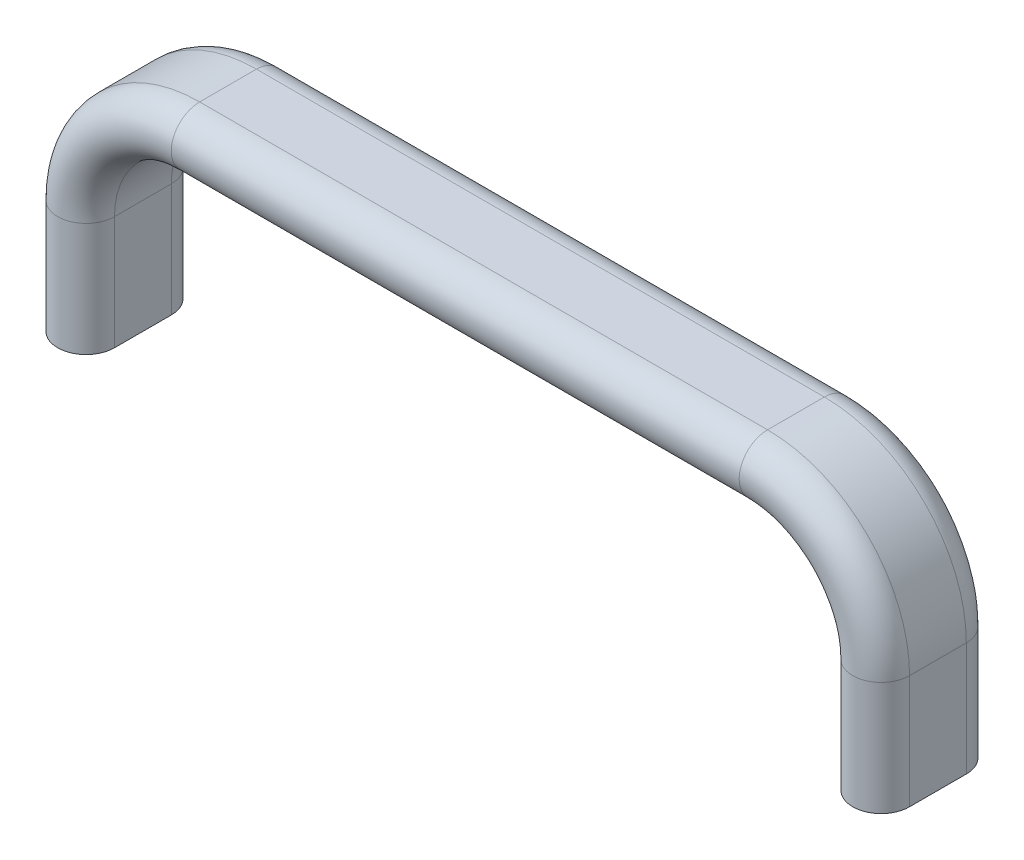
ISO-10303-21;
HEADER;
FILE_DESCRIPTION(('STEP AP214'),'2;1');
FILE_NAME('part.step','',(''),(''),'','','');
FILE_SCHEMA(('AUTOMOTIVE_DESIGN { 1 0 10303 214 1 1 1 1 }'));
ENDSEC;
DATA;
#1=APPLICATION_CONTEXT('core data for automotive mechanical design processes');
#2=APPLICATION_PROTOCOL_DEFINITION('international standard','automotive_design',2000,#1);
#3=PRODUCT_CONTEXT('',#1,'mechanical');
#4=PRODUCT('Part','Part','',(#3));
#5=PRODUCT_RELATED_PRODUCT_CATEGORY('part','',(#4));
#6=PRODUCT_DEFINITION_FORMATION('','',#4);
#7=PRODUCT_DEFINITION_CONTEXT('part definition',#1,'design');
#8=PRODUCT_DEFINITION('design','',#6,#7);
#9=PRODUCT_DEFINITION_SHAPE('','',#8);
#10=(LENGTH_UNIT() NAMED_UNIT(*) SI_UNIT(.MILLI.,.METRE.));
#11=(NAMED_UNIT(*) PLANE_ANGLE_UNIT() SI_UNIT($,.RADIAN.));
#12=(NAMED_UNIT(*) SI_UNIT($,.STERADIAN.) SOLID_ANGLE_UNIT());
#13=UNCERTAINTY_MEASURE_WITH_UNIT(LENGTH_MEASURE(1.E-05),#10,'distance_accuracy_value','');
#14=(GEOMETRIC_REPRESENTATION_CONTEXT(3) GLOBAL_UNCERTAINTY_ASSIGNED_CONTEXT((#13)) GLOBAL_UNIT_ASSIGNED_CONTEXT((#10,
#11,#12)) REPRESENTATION_CONTEXT('',''));
#15=CARTESIAN_POINT('',(0.,0.,0.));
#16=DIRECTION('',(0.,0.,1.));
#17=DIRECTION('',(1.,0.,0.));
#18=AXIS2_PLACEMENT_3D('',#15,#16,#17);
#19=CARTESIAN_POINT('',(70.,0.,-5.));
#20=DIRECTION('',(0.,1.,0.));
#21=DIRECTION('',(0.,0.,-1.));
#22=AXIS2_PLACEMENT_3D('',#19,#20,#21);
#23=PLANE('',#22);
#24=CARTESIAN_POINT('',(70.,0.,-5.));
#25=DIRECTION('',(0.,-1.,0.));
#26=DIRECTION('',(0.,0.,-1.));
#27=AXIS2_PLACEMENT_3D('',#24,#25,#26);
#28=CIRCLE('',#27,5.);
#29=CARTESIAN_POINT('',(65.,0.,-5.));
#30=VERTEX_POINT('',#29);
#31=CARTESIAN_POINT('',(75.,0.,-5.));
#32=VERTEX_POINT('',#31);
#33=EDGE_CURVE('E279',#30,#32,#28,.T.);
#34=ORIENTED_EDGE('',*,*,#33,.T.);
#35=DIRECTION('',(0.,0.,1.));
#36=VECTOR('',#35,1.);
#37=CARTESIAN_POINT('',(75.,0.,5.00000000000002));
#38=LINE('',#37,#36);
#39=CARTESIAN_POINT('',(75.,0.,5.00000000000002));
#40=VERTEX_POINT('',#39);
#41=EDGE_CURVE('E55',#32,#40,#38,.T.);
#42=ORIENTED_EDGE('',*,*,#41,.T.);
#43=CARTESIAN_POINT('',(70.,0.,5.00000000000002));
#44=DIRECTION('',(0.,-1.,0.));
#45=DIRECTION('',(0.,0.,1.));
#46=AXIS2_PLACEMENT_3D('',#43,#44,#45);
#47=CIRCLE('',#46,5.);
#48=CARTESIAN_POINT('',(65.,0.,5.00000000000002));
#49=VERTEX_POINT('',#48);
#50=EDGE_CURVE('E63',#40,#49,#47,.T.);
#51=ORIENTED_EDGE('',*,*,#50,.T.);
#52=DIRECTION('',(0.,0.,-1.));
#53=VECTOR('',#52,1.);
#54=CARTESIAN_POINT('',(65.,0.,-5.));
#55=LINE('',#54,#53);
#56=EDGE_CURVE('E282',#49,#30,#55,.T.);
#57=ORIENTED_EDGE('',*,*,#56,.T.);
#58=EDGE_LOOP('',(#34,#42,#51,#57));
#59=FACE_BOUND('',#58,.T.);
#60=CARTESIAN_POINT('',(70.,0.,0.));
#61=DIRECTION('',(0.,1.,0.));
#62=DIRECTION('',(0.,0.,-1.));
#63=AXIS2_PLACEMENT_3D('',#60,#61,#62);
#64=CIRCLE('',#63,2.5);
#65=CARTESIAN_POINT('',(70.,0.,-2.5));
#66=VERTEX_POINT('',#65);
#67=EDGE_CURVE('E443',#66,#66,#64,.T.);
#68=ORIENTED_EDGE('',*,*,#67,.T.);
#69=EDGE_LOOP('',(#68));
#70=FACE_BOUND('',#69,.T.);
#71=ADVANCED_FACE('F37',(#59,#70),#23,.F.);
#72=CARTESIAN_POINT('',(75.,20.,5.00000000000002));
#73=DIRECTION('',(1.,0.,0.));
#74=DIRECTION('',(0.,0.,-1.));
#75=AXIS2_PLACEMENT_3D('',#72,#73,#74);
#76=PLANE('',#75);
#77=DIRECTION('',(0.,0.,1.));
#78=VECTOR('',#77,1.);
#79=CARTESIAN_POINT('',(75.,20.,5.00000000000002));
#80=LINE('',#79,#78);
#81=CARTESIAN_POINT('',(75.,20.,-5.));
#82=VERTEX_POINT('',#81);
#83=CARTESIAN_POINT('',(75.,20.,5.00000000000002));
#84=VERTEX_POINT('',#83);
#85=EDGE_CURVE('E247',#82,#84,#80,.T.);
#86=ORIENTED_EDGE('',*,*,#85,.T.);
#87=DIRECTION('',(0.,-1.,0.));
#88=VECTOR('',#87,1.);
#89=CARTESIAN_POINT('',(75.,20.,5.00000000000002));
#90=LINE('',#89,#88);
#91=EDGE_CURVE('E47',#84,#40,#90,.T.);
#92=ORIENTED_EDGE('',*,*,#91,.T.);
#93=ORIENTED_EDGE('',*,*,#41,.F.);
#94=DIRECTION('',(0.,-1.,0.));
#95=VECTOR('',#94,1.);
#96=CARTESIAN_POINT('',(75.,20.,-5.));
#97=LINE('',#96,#95);
#98=EDGE_CURVE('E11',#82,#32,#97,.T.);
#99=ORIENTED_EDGE('',*,*,#98,.F.);
#100=EDGE_LOOP('',(#86,#92,#93,#99));
#101=FACE_BOUND('',#100,.T.);
#102=ADVANCED_FACE('F39',(#101),#76,.T.);
#103=CARTESIAN_POINT('',(70.,20.,5.00000000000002));
#104=DIRECTION('',(0.,-1.,0.));
#105=DIRECTION('',(0.,0.,-1.));
#106=AXIS2_PLACEMENT_3D('',#103,#104,#105);
#107=CYLINDRICAL_SURFACE('',#106,5.);
#108=CARTESIAN_POINT('',(70.,20.,5.00000000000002));
#109=DIRECTION('',(0.,-1.,0.));
#110=DIRECTION('',(0.,0.,1.));
#111=AXIS2_PLACEMENT_3D('',#108,#109,#110);
#112=CIRCLE('',#111,5.);
#113=CARTESIAN_POINT('',(65.,20.,5.00000000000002));
#114=VERTEX_POINT('',#113);
#115=EDGE_CURVE('E240',#84,#114,#112,.T.);
#116=ORIENTED_EDGE('',*,*,#115,.T.);
#117=DIRECTION('',(0.,-1.,0.));
#118=VECTOR('',#117,1.);
#119=CARTESIAN_POINT('',(65.,20.,5.00000000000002));
#120=LINE('',#119,#118);
#121=EDGE_CURVE('E242',#114,#49,#120,.T.);
#122=ORIENTED_EDGE('',*,*,#121,.T.);
#123=ORIENTED_EDGE('',*,*,#50,.F.);
#124=ORIENTED_EDGE('',*,*,#91,.F.);
#125=EDGE_LOOP('',(#116,#122,#123,#124));
#126=FACE_BOUND('',#125,.T.);
#127=ADVANCED_FACE('F153',(#126),#107,.T.);
#128=CARTESIAN_POINT('',(65.,20.,-5.));
#129=DIRECTION('',(-1.,0.,0.));
#130=DIRECTION('',(0.,0.,1.));
#131=AXIS2_PLACEMENT_3D('',#128,#129,#130);
#132=PLANE('',#131);
#133=DIRECTION('',(0.,0.,-1.));
#134=VECTOR('',#133,1.);
#135=CARTESIAN_POINT('',(65.,20.,-5.));
#136=LINE('',#135,#134);
#137=CARTESIAN_POINT('',(65.,20.,-5.));
#138=VERTEX_POINT('',#137);
#139=EDGE_CURVE('E248',#114,#138,#136,.T.);
#140=ORIENTED_EDGE('',*,*,#139,.T.);
#141=DIRECTION('',(0.,-1.,0.));
#142=VECTOR('',#141,1.);
#143=CARTESIAN_POINT('',(65.,20.,-5.));
#144=LINE('',#143,#142);
#145=EDGE_CURVE('E290',#138,#30,#144,.T.);
#146=ORIENTED_EDGE('',*,*,#145,.T.);
#147=ORIENTED_EDGE('',*,*,#56,.F.);
#148=ORIENTED_EDGE('',*,*,#121,.F.);
#149=EDGE_LOOP('',(#140,#146,#147,#148));
#150=FACE_BOUND('',#149,.T.);
#151=ADVANCED_FACE('F231',(#150),#132,.T.);
#152=CARTESIAN_POINT('',(70.,20.,-5.));
#153=DIRECTION('',(0.,-1.,0.));
#154=DIRECTION('',(0.,0.,-1.));
#155=AXIS2_PLACEMENT_3D('',#152,#153,#154);
#156=CYLINDRICAL_SURFACE('',#155,5.);
#157=CARTESIAN_POINT('',(70.,20.,-5.));
#158=DIRECTION('',(0.,-1.,0.));
#159=DIRECTION('',(0.,0.,-1.));
#160=AXIS2_PLACEMENT_3D('',#157,#158,#159);
#161=CIRCLE('',#160,5.);
#162=EDGE_CURVE('E259',#138,#82,#161,.T.);
#163=ORIENTED_EDGE('',*,*,#162,.T.);
#164=ORIENTED_EDGE('',*,*,#98,.T.);
#165=ORIENTED_EDGE('',*,*,#33,.F.);
#166=ORIENTED_EDGE('',*,*,#145,.F.);
#167=EDGE_LOOP('',(#163,#164,#165,#166));
#168=FACE_BOUND('',#167,.T.);
#169=ADVANCED_FACE('F227',(#168),#156,.T.);
#170=CARTESIAN_POINT('',(50.,20.,0.));
#171=DIRECTION('',(0.,0.,-1.));
#172=DIRECTION('',(-1.,0.,0.));
#173=AXIS2_PLACEMENT_3D('',#170,#171,#172);
#174=CYLINDRICAL_SURFACE('',#173,25.);
#175=DIRECTION('',(0.,0.,1.));
#176=VECTOR('',#175,1.);
#177=CARTESIAN_POINT('',(50.,45.,5.00000000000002));
#178=LINE('',#177,#176);
#179=CARTESIAN_POINT('',(50.,45.,-5.));
#180=VERTEX_POINT('',#179);
#181=CARTESIAN_POINT('',(50.,45.,5.00000000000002));
#182=VERTEX_POINT('',#181);
#183=EDGE_CURVE('E399',#180,#182,#178,.T.);
#184=ORIENTED_EDGE('',*,*,#183,.T.);
#185=CARTESIAN_POINT('',(50.,20.,5.00000000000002));
#186=DIRECTION('',(0.,0.,-1.));
#187=DIRECTION('',(-1.,0.,0.));
#188=AXIS2_PLACEMENT_3D('',#185,#186,#187);
#189=CIRCLE('',#188,25.);
#190=EDGE_CURVE('E265',#182,#84,#189,.T.);
#191=ORIENTED_EDGE('',*,*,#190,.T.);
#192=ORIENTED_EDGE('',*,*,#85,.F.);
#193=CARTESIAN_POINT('',(50.,20.,-5.));
#194=DIRECTION('',(0.,0.,-1.));
#195=DIRECTION('',(-1.,0.,0.));
#196=AXIS2_PLACEMENT_3D('',#193,#194,#195);
#197=CIRCLE('',#196,25.);
#198=EDGE_CURVE('E270',#180,#82,#197,.T.);
#199=ORIENTED_EDGE('',*,*,#198,.F.);
#200=EDGE_LOOP('',(#184,#191,#192,#199));
#201=FACE_BOUND('',#200,.T.);
#202=ADVANCED_FACE('F223',(#201),#174,.T.);
#203=CARTESIAN_POINT('',(50.,20.,5.00000000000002));
#204=DIRECTION('',(0.,0.,-1.));
#205=DIRECTION('',(-1.,0.,0.));
#206=AXIS2_PLACEMENT_3D('',#203,#204,#205);
#207=TOROIDAL_SURFACE('',#206,20.,5.);
#208=CARTESIAN_POINT('',(50.,40.,5.00000000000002));
#209=DIRECTION('',(1.,0.,0.));
#210=DIRECTION('',(0.,0.,1.));
#211=AXIS2_PLACEMENT_3D('',#208,#209,#210);
#212=CIRCLE('',#211,5.);
#213=CARTESIAN_POINT('',(50.,35.,5.00000000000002));
#214=VERTEX_POINT('',#213);
#215=EDGE_CURVE('E262',#182,#214,#212,.T.);
#216=ORIENTED_EDGE('',*,*,#215,.T.);
#217=CARTESIAN_POINT('',(50.,20.,5.00000000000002));
#218=DIRECTION('',(0.,0.,-1.));
#219=DIRECTION('',(-1.,0.,0.));
#220=AXIS2_PLACEMENT_3D('',#217,#218,#219);
#221=CIRCLE('',#220,15.);
#222=EDGE_CURVE('E253',#214,#114,#221,.T.);
#223=ORIENTED_EDGE('',*,*,#222,.T.);
#224=ORIENTED_EDGE('',*,*,#115,.F.);
#225=ORIENTED_EDGE('',*,*,#190,.F.);
#226=EDGE_LOOP('',(#216,#223,#224,#225));
#227=FACE_BOUND('',#226,.T.);
#228=ADVANCED_FACE('F219',(#227),#207,.T.);
#229=CARTESIAN_POINT('',(50.,20.,0.));
#230=DIRECTION('',(0.,0.,-1.));
#231=DIRECTION('',(-1.,0.,0.));
#232=AXIS2_PLACEMENT_3D('',#229,#230,#231);
#233=CYLINDRICAL_SURFACE('',#232,15.);
#234=DIRECTION('',(0.,0.,-1.));
#235=VECTOR('',#234,1.);
#236=CARTESIAN_POINT('',(50.,35.,-5.));
#237=LINE('',#236,#235);
#238=CARTESIAN_POINT('',(50.,35.,-5.));
#239=VERTEX_POINT('',#238);
#240=EDGE_CURVE('E394',#214,#239,#237,.T.);
#241=ORIENTED_EDGE('',*,*,#240,.T.);
#242=CARTESIAN_POINT('',(50.,20.,-5.));
#243=DIRECTION('',(0.,0.,-1.));
#244=DIRECTION('',(-1.,0.,0.));
#245=AXIS2_PLACEMENT_3D('',#242,#243,#244);
#246=CIRCLE('',#245,15.);
#247=EDGE_CURVE('E255',#239,#138,#246,.T.);
#248=ORIENTED_EDGE('',*,*,#247,.T.);
#249=ORIENTED_EDGE('',*,*,#139,.F.);
#250=ORIENTED_EDGE('',*,*,#222,.F.);
#251=EDGE_LOOP('',(#241,#248,#249,#250));
#252=FACE_BOUND('',#251,.T.);
#253=ADVANCED_FACE('F215',(#252),#233,.F.);
#254=CARTESIAN_POINT('',(50.,20.,-5.));
#255=DIRECTION('',(0.,0.,-1.));
#256=DIRECTION('',(-1.,0.,0.));
#257=AXIS2_PLACEMENT_3D('',#254,#255,#256);
#258=TOROIDAL_SURFACE('',#257,20.,5.);
#259=CARTESIAN_POINT('',(50.,40.,-5.));
#260=DIRECTION('',(1.,0.,0.));
#261=DIRECTION('',(0.,0.,-1.));
#262=AXIS2_PLACEMENT_3D('',#259,#260,#261);
#263=CIRCLE('',#262,5.);
#264=EDGE_CURVE('E390',#239,#180,#263,.T.);
#265=ORIENTED_EDGE('',*,*,#264,.T.);
#266=ORIENTED_EDGE('',*,*,#198,.T.);
#267=ORIENTED_EDGE('',*,*,#162,.F.);
#268=ORIENTED_EDGE('',*,*,#247,.F.);
#269=EDGE_LOOP('',(#265,#266,#267,#268));
#270=FACE_BOUND('',#269,.T.);
#271=ADVANCED_FACE('F211',(#270),#258,.T.);
#272=CARTESIAN_POINT('',(-50.,45.,5.00000000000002));
#273=DIRECTION('',(0.,1.,0.));
#274=DIRECTION('',(-1.,0.,0.));
#275=AXIS2_PLACEMENT_3D('',#272,#273,#274);
#276=PLANE('',#275);
#277=DIRECTION('',(0.,0.,1.));
#278=VECTOR('',#277,1.);
#279=CARTESIAN_POINT('',(-50.,45.,5.00000000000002));
#280=LINE('',#279,#278);
#281=CARTESIAN_POINT('',(-50.,45.,-5.));
#282=VERTEX_POINT('',#281);
#283=CARTESIAN_POINT('',(-50.,45.,5.00000000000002));
#284=VERTEX_POINT('',#283);
#285=EDGE_CURVE('E370',#282,#284,#280,.T.);
#286=ORIENTED_EDGE('',*,*,#285,.T.);
#287=DIRECTION('',(1.,0.,0.));
#288=VECTOR('',#287,1.);
#289=CARTESIAN_POINT('',(-50.,45.,5.00000000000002));
#290=LINE('',#289,#288);
#291=EDGE_CURVE('E411',#284,#182,#290,.T.);
#292=ORIENTED_EDGE('',*,*,#291,.T.);
#293=ORIENTED_EDGE('',*,*,#183,.F.);
#294=DIRECTION('',(1.,0.,0.));
#295=VECTOR('',#294,1.);
#296=CARTESIAN_POINT('',(-50.,45.,-5.));
#297=LINE('',#296,#295);
#298=EDGE_CURVE('E415',#282,#180,#297,.T.);
#299=ORIENTED_EDGE('',*,*,#298,.F.);
#300=EDGE_LOOP('',(#286,#292,#293,#299));
#301=FACE_BOUND('',#300,.T.);
#302=ADVANCED_FACE('F207',(#301),#276,.T.);
#303=CARTESIAN_POINT('',(-50.,40.,5.00000000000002));
#304=DIRECTION('',(1.,0.,0.));
#305=DIRECTION('',(0.,1.,0.));
#306=AXIS2_PLACEMENT_3D('',#303,#304,#305);
#307=CYLINDRICAL_SURFACE('',#306,5.);
#308=CARTESIAN_POINT('',(-50.,40.,5.00000000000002));
#309=DIRECTION('',(1.,0.,0.));
#310=DIRECTION('',(0.,0.,1.));
#311=AXIS2_PLACEMENT_3D('',#308,#309,#310);
#312=CIRCLE('',#311,5.);
#313=CARTESIAN_POINT('',(-50.,35.,5.00000000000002));
#314=VERTEX_POINT('',#313);
#315=EDGE_CURVE('E366',#284,#314,#312,.T.);
#316=ORIENTED_EDGE('',*,*,#315,.T.);
#317=DIRECTION('',(1.,0.,0.));
#318=VECTOR('',#317,1.);
#319=CARTESIAN_POINT('',(-50.,35.,5.00000000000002));
#320=LINE('',#319,#318);
#321=EDGE_CURVE('E407',#314,#214,#320,.T.);
#322=ORIENTED_EDGE('',*,*,#321,.T.);
#323=ORIENTED_EDGE('',*,*,#215,.F.);
#324=ORIENTED_EDGE('',*,*,#291,.F.);
#325=EDGE_LOOP('',(#316,#322,#323,#324));
#326=FACE_BOUND('',#325,.T.);
#327=ADVANCED_FACE('F203',(#326),#307,.T.);
#328=CARTESIAN_POINT('',(-50.,35.,-5.));
#329=DIRECTION('',(0.,-1.,0.));
#330=DIRECTION('',(1.,0.,0.));
#331=AXIS2_PLACEMENT_3D('',#328,#329,#330);
#332=PLANE('',#331);
#333=DIRECTION('',(0.,0.,-1.));
#334=VECTOR('',#333,1.);
#335=CARTESIAN_POINT('',(-50.,35.,-5.));
#336=LINE('',#335,#334);
#337=CARTESIAN_POINT('',(-50.,35.,-5.));
#338=VERTEX_POINT('',#337);
#339=EDGE_CURVE('E362',#314,#338,#336,.T.);
#340=ORIENTED_EDGE('',*,*,#339,.T.);
#341=DIRECTION('',(1.,0.,0.));
#342=VECTOR('',#341,1.);
#343=CARTESIAN_POINT('',(-50.,35.,-5.));
#344=LINE('',#343,#342);
#345=EDGE_CURVE('E403',#338,#239,#344,.T.);
#346=ORIENTED_EDGE('',*,*,#345,.T.);
#347=ORIENTED_EDGE('',*,*,#240,.F.);
#348=ORIENTED_EDGE('',*,*,#321,.F.);
#349=EDGE_LOOP('',(#340,#346,#347,#348));
#350=FACE_BOUND('',#349,.T.);
#351=ADVANCED_FACE('F199',(#350),#332,.T.);
#352=CARTESIAN_POINT('',(-50.,40.,-5.));
#353=DIRECTION('',(1.,0.,0.));
#354=DIRECTION('',(0.,1.,0.));
#355=AXIS2_PLACEMENT_3D('',#352,#353,#354);
#356=CYLINDRICAL_SURFACE('',#355,5.);
#357=CARTESIAN_POINT('',(-50.,40.,-5.));
#358=DIRECTION('',(1.,0.,0.));
#359=DIRECTION('',(0.,0.,-1.));
#360=AXIS2_PLACEMENT_3D('',#357,#358,#359);
#361=CIRCLE('',#360,5.);
#362=EDGE_CURVE('E358',#338,#282,#361,.T.);
#363=ORIENTED_EDGE('',*,*,#362,.T.);
#364=ORIENTED_EDGE('',*,*,#298,.T.);
#365=ORIENTED_EDGE('',*,*,#264,.F.);
#366=ORIENTED_EDGE('',*,*,#345,.F.);
#367=EDGE_LOOP('',(#363,#364,#365,#366));
#368=FACE_BOUND('',#367,.T.);
#369=ADVANCED_FACE('F195',(#368),#356,.T.);
#370=CARTESIAN_POINT('',(-50.,20.,0.));
#371=DIRECTION('',(0.,0.,-1.));
#372=DIRECTION('',(-1.,0.,0.));
#373=AXIS2_PLACEMENT_3D('',#370,#371,#372);
#374=CYLINDRICAL_SURFACE('',#373,25.);
#375=DIRECTION('',(0.,0.,1.));
#376=VECTOR('',#375,1.);
#377=CARTESIAN_POINT('',(-75.,20.,5.00000000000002));
#378=LINE('',#377,#376);
#379=CARTESIAN_POINT('',(-75.,20.,-5.));
#380=VERTEX_POINT('',#379);
#381=CARTESIAN_POINT('',(-75.,20.,5.00000000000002));
#382=VERTEX_POINT('',#381);
#383=EDGE_CURVE('E325',#380,#382,#378,.T.);
#384=ORIENTED_EDGE('',*,*,#383,.T.);
#385=CARTESIAN_POINT('',(-50.,20.,5.00000000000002));
#386=DIRECTION('',(0.,0.,-1.));
#387=DIRECTION('',(-1.,0.,0.));
#388=AXIS2_PLACEMENT_3D('',#385,#386,#387);
#389=CIRCLE('',#388,25.);
#390=EDGE_CURVE('E382',#382,#284,#389,.T.);
#391=ORIENTED_EDGE('',*,*,#390,.T.);
#392=ORIENTED_EDGE('',*,*,#285,.F.);
#393=CARTESIAN_POINT('',(-50.,20.,-5.));
#394=DIRECTION('',(0.,0.,-1.));
#395=DIRECTION('',(-1.,0.,0.));
#396=AXIS2_PLACEMENT_3D('',#393,#394,#395);
#397=CIRCLE('',#396,25.);
#398=EDGE_CURVE('E386',#380,#282,#397,.T.);
#399=ORIENTED_EDGE('',*,*,#398,.F.);
#400=EDGE_LOOP('',(#384,#391,#392,#399));
#401=FACE_BOUND('',#400,.T.);
#402=ADVANCED_FACE('F191',(#401),#374,.T.);
#403=CARTESIAN_POINT('',(-50.,20.,5.00000000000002));
#404=DIRECTION('',(0.,0.,-1.));
#405=DIRECTION('',(-1.,0.,0.));
#406=AXIS2_PLACEMENT_3D('',#403,#404,#405);
#407=TOROIDAL_SURFACE('',#406,20.,5.);
#408=CARTESIAN_POINT('',(-70.,20.,5.00000000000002));
#409=DIRECTION('',(0.,1.,0.));
#410=DIRECTION('',(0.,0.,1.));
#411=AXIS2_PLACEMENT_3D('',#408,#409,#410);
#412=CIRCLE('',#411,5.);
#413=CARTESIAN_POINT('',(-65.,20.,5.00000000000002));
#414=VERTEX_POINT('',#413);
#415=EDGE_CURVE('E330',#382,#414,#412,.T.);
#416=ORIENTED_EDGE('',*,*,#415,.T.);
#417=CARTESIAN_POINT('',(-50.,20.,5.00000000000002));
#418=DIRECTION('',(0.,0.,-1.));
#419=DIRECTION('',(-1.,0.,0.));
#420=AXIS2_PLACEMENT_3D('',#417,#418,#419);
#421=CIRCLE('',#420,15.);
#422=EDGE_CURVE('E378',#414,#314,#421,.T.);
#423=ORIENTED_EDGE('',*,*,#422,.T.);
#424=ORIENTED_EDGE('',*,*,#315,.F.);
#425=ORIENTED_EDGE('',*,*,#390,.F.);
#426=EDGE_LOOP('',(#416,#423,#424,#425));
#427=FACE_BOUND('',#426,.T.);
#428=ADVANCED_FACE('F187',(#427),#407,.T.);
#429=CARTESIAN_POINT('',(-50.,20.,0.));
#430=DIRECTION('',(0.,0.,-1.));
#431=DIRECTION('',(-1.,0.,0.));
#432=AXIS2_PLACEMENT_3D('',#429,#430,#431);
#433=CYLINDRICAL_SURFACE('',#432,15.);
#434=DIRECTION('',(0.,0.,-1.));
#435=VECTOR('',#434,1.);
#436=CARTESIAN_POINT('',(-65.,20.,-5.));
#437=LINE('',#436,#435);
#438=CARTESIAN_POINT('',(-65.,20.,-5.));
#439=VERTEX_POINT('',#438);
#440=EDGE_CURVE('E333',#414,#439,#437,.T.);
#441=ORIENTED_EDGE('',*,*,#440,.T.);
#442=CARTESIAN_POINT('',(-50.,20.,-5.));
#443=DIRECTION('',(0.,0.,-1.));
#444=DIRECTION('',(-1.,0.,0.));
#445=AXIS2_PLACEMENT_3D('',#442,#443,#444);
#446=CIRCLE('',#445,15.);
#447=EDGE_CURVE('E374',#439,#338,#446,.T.);
#448=ORIENTED_EDGE('',*,*,#447,.T.);
#449=ORIENTED_EDGE('',*,*,#339,.F.);
#450=ORIENTED_EDGE('',*,*,#422,.F.);
#451=EDGE_LOOP('',(#441,#448,#449,#450));
#452=FACE_BOUND('',#451,.T.);
#453=ADVANCED_FACE('F183',(#452),#433,.F.);
#454=CARTESIAN_POINT('',(-50.,20.,-5.));
#455=DIRECTION('',(0.,0.,-1.));
#456=DIRECTION('',(-1.,0.,0.));
#457=AXIS2_PLACEMENT_3D('',#454,#455,#456);
#458=TOROIDAL_SURFACE('',#457,20.,5.);
#459=CARTESIAN_POINT('',(-70.,20.,-5.));
#460=DIRECTION('',(0.,1.,0.));
#461=DIRECTION('',(0.,0.,-1.));
#462=AXIS2_PLACEMENT_3D('',#459,#460,#461);
#463=CIRCLE('',#462,5.);
#464=EDGE_CURVE('E321',#439,#380,#463,.T.);
#465=ORIENTED_EDGE('',*,*,#464,.T.);
#466=ORIENTED_EDGE('',*,*,#398,.T.);
#467=ORIENTED_EDGE('',*,*,#362,.F.);
#468=ORIENTED_EDGE('',*,*,#447,.F.);
#469=EDGE_LOOP('',(#465,#466,#467,#468));
#470=FACE_BOUND('',#469,.T.);
#471=ADVANCED_FACE('F179',(#470),#458,.T.);
#472=CARTESIAN_POINT('',(-70.,20.,-5.));
#473=DIRECTION('',(0.,-1.,0.));
#474=DIRECTION('',(0.,0.,-1.));
#475=AXIS2_PLACEMENT_3D('',#472,#473,#474);
#476=CYLINDRICAL_SURFACE('',#475,5.);
#477=CARTESIAN_POINT('',(-70.,0.,-5.));
#478=DIRECTION('',(0.,1.,0.));
#479=DIRECTION('',(0.,0.,-1.));
#480=AXIS2_PLACEMENT_3D('',#477,#478,#479);
#481=CIRCLE('',#480,5.);
#482=CARTESIAN_POINT('',(-65.,0.,-5.));
#483=VERTEX_POINT('',#482);
#484=CARTESIAN_POINT('',(-75.,0.,-5.));
#485=VERTEX_POINT('',#484);
#486=EDGE_CURVE('E299',#483,#485,#481,.T.);
#487=ORIENTED_EDGE('',*,*,#486,.T.);
#488=DIRECTION('',(0.,-1.,0.));
#489=VECTOR('',#488,1.);
#490=CARTESIAN_POINT('',(-75.,20.,-5.));
#491=LINE('',#490,#489);
#492=EDGE_CURVE('E355',#380,#485,#491,.T.);
#493=ORIENTED_EDGE('',*,*,#492,.F.);
#494=ORIENTED_EDGE('',*,*,#464,.F.);
#495=DIRECTION('',(0.,-1.,0.));
#496=VECTOR('',#495,1.);
#497=CARTESIAN_POINT('',(-65.,20.,-5.));
#498=LINE('',#497,#496);
#499=EDGE_CURVE('E336',#439,#483,#498,.T.);
#500=ORIENTED_EDGE('',*,*,#499,.T.);
#501=EDGE_LOOP('',(#487,#493,#494,#500));
#502=FACE_BOUND('',#501,.T.);
#503=ADVANCED_FACE('F175',(#502),#476,.T.);
#504=CARTESIAN_POINT('',(-75.,20.,5.00000000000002));
#505=DIRECTION('',(1.,0.,0.));
#506=DIRECTION('',(0.,0.,-1.));
#507=AXIS2_PLACEMENT_3D('',#504,#505,#506);
#508=PLANE('',#507);
#509=DIRECTION('',(0.,0.,1.));
#510=VECTOR('',#509,1.);
#511=CARTESIAN_POINT('',(-75.,0.,5.00000000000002));
#512=LINE('',#511,#510);
#513=CARTESIAN_POINT('',(-75.,0.,5.00000000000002));
#514=VERTEX_POINT('',#513);
#515=EDGE_CURVE('E306',#485,#514,#512,.T.);
#516=ORIENTED_EDGE('',*,*,#515,.T.);
#517=DIRECTION('',(0.,-1.,0.));
#518=VECTOR('',#517,1.);
#519=CARTESIAN_POINT('',(-75.,20.,5.00000000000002));
#520=LINE('',#519,#518);
#521=EDGE_CURVE('E351',#382,#514,#520,.T.);
#522=ORIENTED_EDGE('',*,*,#521,.F.);
#523=ORIENTED_EDGE('',*,*,#383,.F.);
#524=ORIENTED_EDGE('',*,*,#492,.T.);
#525=EDGE_LOOP('',(#516,#522,#523,#524));
#526=FACE_BOUND('',#525,.T.);
#527=ADVANCED_FACE('F171',(#526),#508,.F.);
#528=CARTESIAN_POINT('',(-70.,20.,5.00000000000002));
#529=DIRECTION('',(0.,-1.,0.));
#530=DIRECTION('',(0.,0.,-1.));
#531=AXIS2_PLACEMENT_3D('',#528,#529,#530);
#532=CYLINDRICAL_SURFACE('',#531,5.);
#533=CARTESIAN_POINT('',(-70.,0.,5.00000000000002));
#534=DIRECTION('',(0.,1.,0.));
#535=DIRECTION('',(0.,0.,1.));
#536=AXIS2_PLACEMENT_3D('',#533,#534,#535);
#537=CIRCLE('',#536,5.);
#538=CARTESIAN_POINT('',(-65.,0.,5.00000000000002));
#539=VERTEX_POINT('',#538);
#540=EDGE_CURVE('E340',#514,#539,#537,.T.);
#541=ORIENTED_EDGE('',*,*,#540,.T.);
#542=DIRECTION('',(0.,-1.,0.));
#543=VECTOR('',#542,1.);
#544=CARTESIAN_POINT('',(-65.,20.,5.00000000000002));
#545=LINE('',#544,#543);
#546=EDGE_CURVE('E347',#414,#539,#545,.T.);
#547=ORIENTED_EDGE('',*,*,#546,.F.);
#548=ORIENTED_EDGE('',*,*,#415,.F.);
#549=ORIENTED_EDGE('',*,*,#521,.T.);
#550=EDGE_LOOP('',(#541,#547,#548,#549));
#551=FACE_BOUND('',#550,.T.);
#552=ADVANCED_FACE('F167',(#551),#532,.T.);
#553=CARTESIAN_POINT('',(-65.,20.,-5.));
#554=DIRECTION('',(-1.,0.,0.));
#555=DIRECTION('',(0.,0.,1.));
#556=AXIS2_PLACEMENT_3D('',#553,#554,#555);
#557=PLANE('',#556);
#558=DIRECTION('',(0.,0.,-1.));
#559=VECTOR('',#558,1.);
#560=CARTESIAN_POINT('',(-65.,0.,-5.));
#561=LINE('',#560,#559);
#562=EDGE_CURVE('E326',#539,#483,#561,.T.);
#563=ORIENTED_EDGE('',*,*,#562,.T.);
#564=ORIENTED_EDGE('',*,*,#499,.F.);
#565=ORIENTED_EDGE('',*,*,#440,.F.);
#566=ORIENTED_EDGE('',*,*,#546,.T.);
#567=EDGE_LOOP('',(#563,#564,#565,#566));
#568=FACE_BOUND('',#567,.T.);
#569=ADVANCED_FACE('F163',(#568),#557,.F.);
#570=CARTESIAN_POINT('',(-70.,0.,-5.));
#571=DIRECTION('',(0.,-1.,0.));
#572=DIRECTION('',(0.,0.,-1.));
#573=AXIS2_PLACEMENT_3D('',#570,#571,#572);
#574=PLANE('',#573);
#575=CARTESIAN_POINT('',(-70.,0.,0.));
#576=DIRECTION('',(0.,-1.,0.));
#577=DIRECTION('',(0.,0.,-1.));
#578=AXIS2_PLACEMENT_3D('',#575,#576,#577);
#579=CIRCLE('',#578,2.5);
#580=CARTESIAN_POINT('',(-70.,0.,-2.5));
#581=VERTEX_POINT('',#580);
#582=EDGE_CURVE('E310',#581,#581,#579,.T.);
#583=ORIENTED_EDGE('',*,*,#582,.F.);
#584=EDGE_LOOP('',(#583));
#585=FACE_BOUND('',#584,.T.);
#586=ORIENTED_EDGE('',*,*,#486,.F.);
#587=ORIENTED_EDGE('',*,*,#562,.F.);
#588=ORIENTED_EDGE('',*,*,#540,.F.);
#589=ORIENTED_EDGE('',*,*,#515,.F.);
#590=EDGE_LOOP('',(#586,#587,#588,#589));
#591=FACE_BOUND('',#590,.T.);
#592=ADVANCED_FACE('F159',(#585,#591),#574,.T.);
#593=CARTESIAN_POINT('',(-70.,10.,0.));
#594=DIRECTION('',(0.,-1.,0.));
#595=DIRECTION('',(0.,0.,-1.));
#596=AXIS2_PLACEMENT_3D('',#593,#594,#595);
#597=PLANE('',#596);
#598=CARTESIAN_POINT('',(-70.,10.,0.));
#599=DIRECTION('',(0.,-1.,0.));
#600=DIRECTION('',(0.,0.,-1.));
#601=AXIS2_PLACEMENT_3D('',#598,#599,#600);
#602=CIRCLE('',#601,2.5);
#603=CARTESIAN_POINT('',(-70.,10.,-2.5));
#604=VERTEX_POINT('',#603);
#605=EDGE_CURVE('E300',#604,#604,#602,.T.);
#606=ORIENTED_EDGE('',*,*,#605,.T.);
#607=EDGE_LOOP('',(#606));
#608=FACE_BOUND('',#607,.T.);
#609=CARTESIAN_POINT('',(-70.,10.,0.));
#610=DIRECTION('',(0.,-1.,0.));
#611=DIRECTION('',(0.,0.,-1.));
#612=AXIS2_PLACEMENT_3D('',#609,#610,#611);
#613=CIRCLE('',#612,2.09999999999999);
#614=CARTESIAN_POINT('',(-70.,10.,-2.09999999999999));
#615=VERTEX_POINT('',#614);
#616=EDGE_CURVE('E296',#615,#615,#613,.F.);
#617=ORIENTED_EDGE('',*,*,#616,.T.);
#618=EDGE_LOOP('',(#617));
#619=FACE_BOUND('',#618,.T.);
#620=ADVANCED_FACE('F162',(#608,#619),#597,.T.);
#621=CARTESIAN_POINT('',(-70.,10.,0.));
#622=DIRECTION('',(0.,-1.,0.));
#623=DIRECTION('',(0.,0.,-1.));
#624=AXIS2_PLACEMENT_3D('',#621,#622,#623);
#625=CYLINDRICAL_SURFACE('',#624,2.5);
#626=ORIENTED_EDGE('',*,*,#605,.F.);
#627=EDGE_LOOP('',(#626));
#628=FACE_BOUND('',#627,.T.);
#629=ORIENTED_EDGE('',*,*,#582,.T.);
#630=EDGE_LOOP('',(#629));
#631=FACE_BOUND('',#630,.T.);
#632=ADVANCED_FACE('F470',(#628,#631),#625,.F.);
#633=CARTESIAN_POINT('',(-70.,12.5,0.));
#634=DIRECTION('',(0.,-1.,0.));
#635=DIRECTION('',(0.,0.,-1.));
#636=AXIS2_PLACEMENT_3D('',#633,#634,#635);
#637=CYLINDRICAL_SURFACE('',#636,2.09999999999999);
#638=CARTESIAN_POINT('',(-70.,12.5,0.));
#639=DIRECTION('',(0.,1.,0.));
#640=DIRECTION('',(0.,0.,1.));
#641=AXIS2_PLACEMENT_3D('',#638,#639,#640);
#642=CIRCLE('',#641,2.10000000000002);
#643=CARTESIAN_POINT('',(-70.,12.5,2.10000000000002));
#644=VERTEX_POINT('',#643);
#645=EDGE_CURVE('E316',#644,#644,#642,.T.);
#646=ORIENTED_EDGE('',*,*,#645,.T.);
#647=EDGE_LOOP('',(#646));
#648=FACE_BOUND('',#647,.T.);
#649=ORIENTED_EDGE('',*,*,#616,.F.);
#650=EDGE_LOOP('',(#649));
#651=FACE_BOUND('',#650,.T.);
#652=ADVANCED_FACE('F157',(#648,#651),#637,.F.);
#653=CARTESIAN_POINT('',(-70.,13.7124355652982,0.));
#654=DIRECTION('',(0.,-1.,0.));
#655=DIRECTION('',(0.,0.,-1.));
#656=AXIS2_PLACEMENT_3D('',#653,#654,#655);
#657=CONICAL_SURFACE('',#656,0.,1.0471975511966);
#658=ORIENTED_EDGE('',*,*,#645,.F.);
#659=EDGE_LOOP('',(#658));
#660=FACE_BOUND('',#659,.T.);
#661=CARTESIAN_POINT('',(-70.,13.7124355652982,0.));
#662=VERTEX_POINT('',#661);
#663=VERTEX_LOOP('',#662);
#664=FACE_BOUND('',#663,.T.);
#665=ADVANCED_FACE('F459',(#660,#664),#657,.F.);
#666=CARTESIAN_POINT('',(70.,10.,0.));
#667=DIRECTION('',(0.,-1.,0.));
#668=DIRECTION('',(0.,0.,-1.));
#669=AXIS2_PLACEMENT_3D('',#666,#667,#668);
#670=CYLINDRICAL_SURFACE('',#669,2.5);
#671=CARTESIAN_POINT('',(70.,10.,0.));
#672=DIRECTION('',(0.,1.,0.));
#673=DIRECTION('',(0.,0.,-1.));
#674=AXIS2_PLACEMENT_3D('',#671,#672,#673);
#675=CIRCLE('',#674,2.5);
#676=CARTESIAN_POINT('',(70.,10.,-2.5));
#677=VERTEX_POINT('',#676);
#678=EDGE_CURVE('E446',#677,#677,#675,.T.);
#679=ORIENTED_EDGE('',*,*,#678,.T.);
#680=EDGE_LOOP('',(#679));
#681=FACE_BOUND('',#680,.T.);
#682=ORIENTED_EDGE('',*,*,#67,.F.);
#683=EDGE_LOOP('',(#682));
#684=FACE_BOUND('',#683,.T.);
#685=ADVANCED_FACE('F457',(#681,#684),#670,.F.);
#686=CARTESIAN_POINT('',(70.,10.,0.));
#687=DIRECTION('',(0.,-1.,0.));
#688=DIRECTION('',(0.,0.,-1.));
#689=AXIS2_PLACEMENT_3D('',#686,#687,#688);
#690=PLANE('',#689);
#691=CARTESIAN_POINT('',(70.,10.,0.));
#692=DIRECTION('',(0.,-1.,0.));
#693=DIRECTION('',(0.,0.,-1.));
#694=AXIS2_PLACEMENT_3D('',#691,#692,#693);
#695=CIRCLE('',#694,2.09999999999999);
#696=CARTESIAN_POINT('',(70.,10.,-2.09999999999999));
#697=VERTEX_POINT('',#696);
#698=EDGE_CURVE('E41',#697,#697,#695,.T.);
#699=ORIENTED_EDGE('',*,*,#698,.F.);
#700=EDGE_LOOP('',(#699));
#701=FACE_BOUND('',#700,.T.);
#702=ORIENTED_EDGE('',*,*,#678,.F.);
#703=EDGE_LOOP('',(#702));
#704=FACE_BOUND('',#703,.T.);
#705=ADVANCED_FACE('F142',(#701,#704),#690,.T.);
#706=CARTESIAN_POINT('',(70.,12.5,0.));
#707=DIRECTION('',(0.,-1.,0.));
#708=DIRECTION('',(0.,0.,-1.));
#709=AXIS2_PLACEMENT_3D('',#706,#707,#708);
#710=CYLINDRICAL_SURFACE('',#709,2.09999999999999);
#711=CARTESIAN_POINT('',(70.,12.5,0.));
#712=DIRECTION('',(0.,-1.,0.));
#713=DIRECTION('',(0.,0.,1.));
#714=AXIS2_PLACEMENT_3D('',#711,#712,#713);
#715=CIRCLE('',#714,2.10000000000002);
#716=CARTESIAN_POINT('',(70.,12.5,2.10000000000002));
#717=VERTEX_POINT('',#716);
#718=EDGE_CURVE('E442',#717,#717,#715,.T.);
#719=ORIENTED_EDGE('',*,*,#718,.F.);
#720=EDGE_LOOP('',(#719));
#721=FACE_BOUND('',#720,.T.);
#722=ORIENTED_EDGE('',*,*,#698,.T.);
#723=EDGE_LOOP('',(#722));
#724=FACE_BOUND('',#723,.T.);
#725=ADVANCED_FACE('F136',(#721,#724),#710,.F.);
#726=CARTESIAN_POINT('',(70.,13.7124355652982,0.));
#727=DIRECTION('',(0.,-1.,0.));
#728=DIRECTION('',(0.,0.,-1.));
#729=AXIS2_PLACEMENT_3D('',#726,#727,#728);
#730=CONICAL_SURFACE('',#729,0.,1.0471975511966);
#731=ORIENTED_EDGE('',*,*,#718,.T.);
#732=EDGE_LOOP('',(#731));
#733=FACE_BOUND('',#732,.T.);
#734=CARTESIAN_POINT('',(70.,13.7124355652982,0.));
#735=VERTEX_POINT('',#734);
#736=VERTEX_LOOP('',#735);
#737=FACE_BOUND('',#736,.T.);
#738=ADVANCED_FACE('F134',(#733,#737),#730,.F.);
#739=CLOSED_SHELL('',(#71,#102,#127,#151,#169,#202,#228,#253,#271,#302,#327,#351,#369,#402,#428,
#453,#471,#503,#527,#552,#569,#592,#620,#632,#652,#665,#685,#705,#725,#738));
#740=MANIFOLD_SOLID_BREP('B2',#739);
#741=ADVANCED_BREP_SHAPE_REPRESENTATION('',(#18,#740),#14);
#742=SHAPE_DEFINITION_REPRESENTATION(#9,#741);
ENDSEC;
END-ISO-10303-21;
